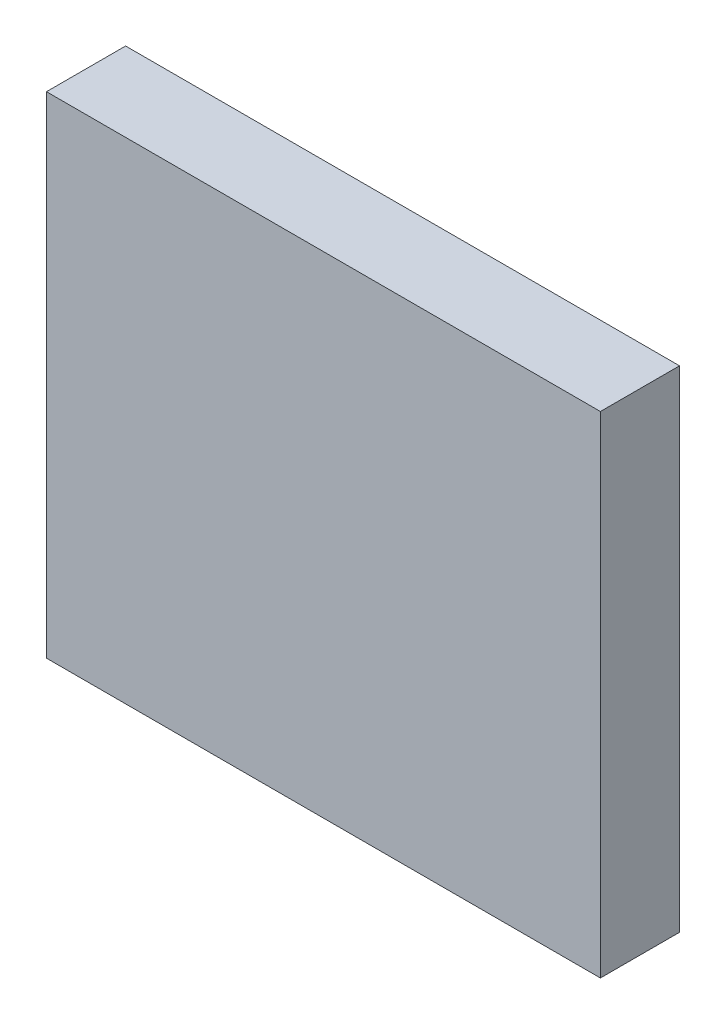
ISO-10303-21;
HEADER;
FILE_DESCRIPTION(('STEP AP214'),'2;1');
FILE_NAME('part.step','',(''),(''),'','','');
FILE_SCHEMA(('AUTOMOTIVE_DESIGN { 1 0 10303 214 1 1 1 1 }'));
ENDSEC;
DATA;
#1=APPLICATION_CONTEXT('core data for automotive mechanical design processes');
#2=APPLICATION_PROTOCOL_DEFINITION('international standard','automotive_design',2000,#1);
#3=PRODUCT_CONTEXT('',#1,'mechanical');
#4=PRODUCT('Part','Part','',(#3));
#5=PRODUCT_RELATED_PRODUCT_CATEGORY('part','',(#4));
#6=PRODUCT_DEFINITION_FORMATION('','',#4);
#7=PRODUCT_DEFINITION_CONTEXT('part definition',#1,'design');
#8=PRODUCT_DEFINITION('design','',#6,#7);
#9=PRODUCT_DEFINITION_SHAPE('','',#8);
#10=(LENGTH_UNIT() NAMED_UNIT(*) SI_UNIT(.MILLI.,.METRE.));
#11=(NAMED_UNIT(*) PLANE_ANGLE_UNIT() SI_UNIT($,.RADIAN.));
#12=(NAMED_UNIT(*) SI_UNIT($,.STERADIAN.) SOLID_ANGLE_UNIT());
#13=UNCERTAINTY_MEASURE_WITH_UNIT(LENGTH_MEASURE(1.E-05),#10,'distance_accuracy_value','');
#14=(GEOMETRIC_REPRESENTATION_CONTEXT(3) GLOBAL_UNCERTAINTY_ASSIGNED_CONTEXT((#13)) GLOBAL_UNIT_ASSIGNED_CONTEXT((#10,
#11,#12)) REPRESENTATION_CONTEXT('',''));
#15=CARTESIAN_POINT('',(0.,0.,0.));
#16=DIRECTION('',(0.,0.,1.));
#17=DIRECTION('',(1.,0.,0.));
#18=AXIS2_PLACEMENT_3D('',#15,#16,#17);
#19=CARTESIAN_POINT('',(0.,0.,5.));
#20=DIRECTION('',(1.,0.,0.));
#21=DIRECTION('',(0.,0.,-1.));
#22=AXIS2_PLACEMENT_3D('',#19,#20,#21);
#23=PLANE('',#22);
#24=DIRECTION('',(0.,-1.,0.));
#25=VECTOR('',#24,1.);
#26=CARTESIAN_POINT('',(0.,0.,0.));
#27=LINE('',#26,#25);
#28=CARTESIAN_POINT('',(0.,31.,0.));
#29=VERTEX_POINT('',#28);
#30=CARTESIAN_POINT('',(0.,0.,0.));
#31=VERTEX_POINT('',#30);
#32=EDGE_CURVE('E96',#29,#31,#27,.T.);
#33=ORIENTED_EDGE('',*,*,#32,.T.);
#34=DIRECTION('',(0.,0.,-1.));
#35=VECTOR('',#34,1.);
#36=CARTESIAN_POINT('',(0.,0.,5.));
#37=LINE('',#36,#35);
#38=CARTESIAN_POINT('',(0.,0.,5.));
#39=VERTEX_POINT('',#38);
#40=EDGE_CURVE('E11',#39,#31,#37,.T.);
#41=ORIENTED_EDGE('',*,*,#40,.F.);
#42=DIRECTION('',(0.,-1.,0.));
#43=VECTOR('',#42,1.);
#44=CARTESIAN_POINT('',(0.,0.,5.));
#45=LINE('',#44,#43);
#46=CARTESIAN_POINT('',(0.,31.,5.));
#47=VERTEX_POINT('',#46);
#48=EDGE_CURVE('E84',#47,#39,#45,.T.);
#49=ORIENTED_EDGE('',*,*,#48,.F.);
#50=DIRECTION('',(0.,0.,-1.));
#51=VECTOR('',#50,1.);
#52=CARTESIAN_POINT('',(0.,31.,5.));
#53=LINE('',#52,#51);
#54=EDGE_CURVE('E92',#47,#29,#53,.T.);
#55=ORIENTED_EDGE('',*,*,#54,.T.);
#56=EDGE_LOOP('',(#33,#41,#49,#55));
#57=FACE_BOUND('',#56,.T.);
#58=ADVANCED_FACE('F33',(#57),#23,.F.);
#59=CARTESIAN_POINT('',(0.,0.,5.));
#60=DIRECTION('',(0.,1.,0.));
#61=DIRECTION('',(0.,0.,1.));
#62=AXIS2_PLACEMENT_3D('',#59,#60,#61);
#63=PLANE('',#62);
#64=DIRECTION('',(1.,0.,0.));
#65=VECTOR('',#64,1.);
#66=CARTESIAN_POINT('',(0.,0.,0.));
#67=LINE('',#66,#65);
#68=CARTESIAN_POINT('',(35.,0.,0.));
#69=VERTEX_POINT('',#68);
#70=EDGE_CURVE('E88',#31,#69,#67,.T.);
#71=ORIENTED_EDGE('',*,*,#70,.T.);
#72=DIRECTION('',(0.,0.,-1.));
#73=VECTOR('',#72,1.);
#74=CARTESIAN_POINT('',(35.,0.,5.));
#75=LINE('',#74,#73);
#76=CARTESIAN_POINT('',(35.,0.,5.));
#77=VERTEX_POINT('',#76);
#78=EDGE_CURVE('E41',#77,#69,#75,.T.);
#79=ORIENTED_EDGE('',*,*,#78,.F.);
#80=DIRECTION('',(1.,0.,0.));
#81=VECTOR('',#80,1.);
#82=CARTESIAN_POINT('',(0.,0.,5.));
#83=LINE('',#82,#81);
#84=EDGE_CURVE('E79',#39,#77,#83,.T.);
#85=ORIENTED_EDGE('',*,*,#84,.F.);
#86=ORIENTED_EDGE('',*,*,#40,.T.);
#87=EDGE_LOOP('',(#71,#79,#85,#86));
#88=FACE_BOUND('',#87,.T.);
#89=ADVANCED_FACE('F87',(#88),#63,.F.);
#90=CARTESIAN_POINT('',(35.,0.,5.));
#91=DIRECTION('',(-1.,0.,0.));
#92=DIRECTION('',(0.,0.,1.));
#93=AXIS2_PLACEMENT_3D('',#90,#91,#92);
#94=PLANE('',#93);
#95=DIRECTION('',(0.,1.,0.));
#96=VECTOR('',#95,1.);
#97=CARTESIAN_POINT('',(35.,0.,0.));
#98=LINE('',#97,#96);
#99=CARTESIAN_POINT('',(35.,31.,0.));
#100=VERTEX_POINT('',#99);
#101=EDGE_CURVE('E66',#69,#100,#98,.T.);
#102=ORIENTED_EDGE('',*,*,#101,.T.);
#103=DIRECTION('',(0.,0.,-1.));
#104=VECTOR('',#103,1.);
#105=CARTESIAN_POINT('',(35.,31.,5.));
#106=LINE('',#105,#104);
#107=CARTESIAN_POINT('',(35.,31.,5.));
#108=VERTEX_POINT('',#107);
#109=EDGE_CURVE('E89',#108,#100,#106,.T.);
#110=ORIENTED_EDGE('',*,*,#109,.F.);
#111=DIRECTION('',(0.,1.,0.));
#112=VECTOR('',#111,1.);
#113=CARTESIAN_POINT('',(35.,0.,5.));
#114=LINE('',#113,#112);
#115=EDGE_CURVE('E82',#77,#108,#114,.T.);
#116=ORIENTED_EDGE('',*,*,#115,.F.);
#117=ORIENTED_EDGE('',*,*,#78,.T.);
#118=EDGE_LOOP('',(#102,#110,#116,#117));
#119=FACE_BOUND('',#118,.T.);
#120=ADVANCED_FACE('F90',(#119),#94,.F.);
#121=CARTESIAN_POINT('',(0.,31.,5.));
#122=DIRECTION('',(0.,-1.,0.));
#123=DIRECTION('',(0.,0.,-1.));
#124=AXIS2_PLACEMENT_3D('',#121,#122,#123);
#125=PLANE('',#124);
#126=DIRECTION('',(-1.,0.,0.));
#127=VECTOR('',#126,1.);
#128=CARTESIAN_POINT('',(0.,31.,0.));
#129=LINE('',#128,#127);
#130=EDGE_CURVE('E72',#100,#29,#129,.T.);
#131=ORIENTED_EDGE('',*,*,#130,.T.);
#132=ORIENTED_EDGE('',*,*,#54,.F.);
#133=DIRECTION('',(-1.,0.,0.));
#134=VECTOR('',#133,1.);
#135=CARTESIAN_POINT('',(0.,31.,5.));
#136=LINE('',#135,#134);
#137=EDGE_CURVE('E49',#108,#47,#136,.T.);
#138=ORIENTED_EDGE('',*,*,#137,.F.);
#139=ORIENTED_EDGE('',*,*,#109,.T.);
#140=EDGE_LOOP('',(#131,#132,#138,#139));
#141=FACE_BOUND('',#140,.T.);
#142=ADVANCED_FACE('F103',(#141),#125,.F.);
#143=CARTESIAN_POINT('',(0.,0.,5.));
#144=DIRECTION('',(0.,0.,-1.));
#145=DIRECTION('',(-1.,0.,0.));
#146=AXIS2_PLACEMENT_3D('',#143,#144,#145);
#147=PLANE('',#146);
#148=ORIENTED_EDGE('',*,*,#48,.T.);
#149=ORIENTED_EDGE('',*,*,#84,.T.);
#150=ORIENTED_EDGE('',*,*,#115,.T.);
#151=ORIENTED_EDGE('',*,*,#137,.T.);
#152=EDGE_LOOP('',(#148,#149,#150,#151));
#153=FACE_BOUND('',#152,.T.);
#154=ADVANCED_FACE('F80',(#153),#147,.F.);
#155=CARTESIAN_POINT('',(0.,0.,0.));
#156=DIRECTION('',(0.,0.,-1.));
#157=DIRECTION('',(-1.,0.,0.));
#158=AXIS2_PLACEMENT_3D('',#155,#156,#157);
#159=PLANE('',#158);
#160=ORIENTED_EDGE('',*,*,#32,.F.);
#161=ORIENTED_EDGE('',*,*,#130,.F.);
#162=ORIENTED_EDGE('',*,*,#101,.F.);
#163=ORIENTED_EDGE('',*,*,#70,.F.);
#164=EDGE_LOOP('',(#160,#161,#162,#163));
#165=FACE_BOUND('',#164,.T.);
#166=ADVANCED_FACE('F106',(#165),#159,.T.);
#167=CLOSED_SHELL('',(#58,#89,#120,#142,#154,#166));
#168=MANIFOLD_SOLID_BREP('B2',#167);
#169=ADVANCED_BREP_SHAPE_REPRESENTATION('',(#18,#168),#14);
#170=SHAPE_DEFINITION_REPRESENTATION(#9,#169);
ENDSEC;
END-ISO-10303-21;
